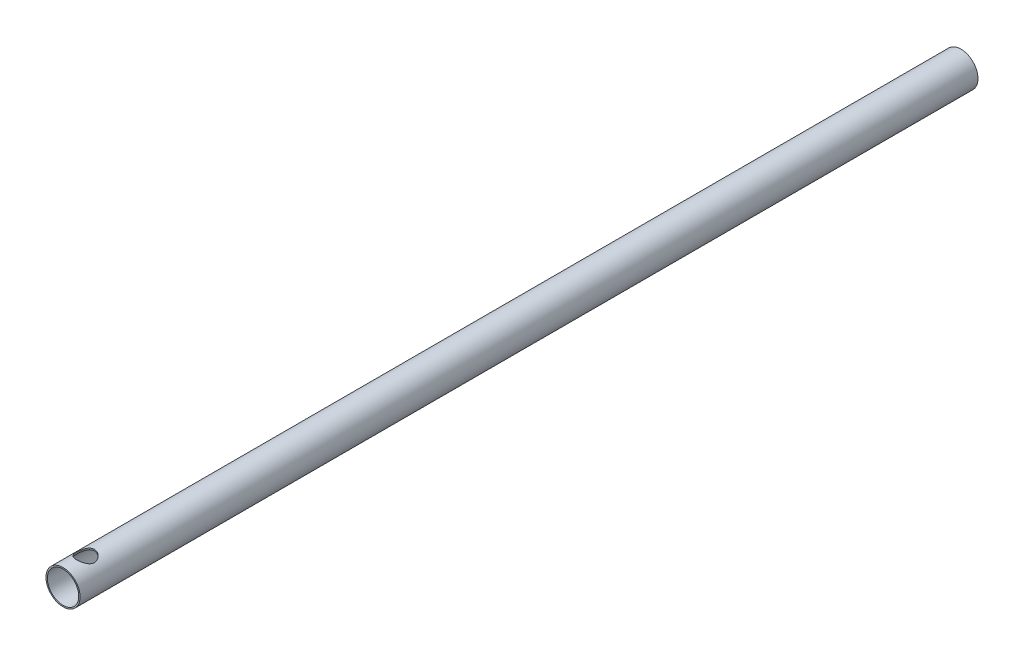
from build123d import *

# Parameters (mm, degrees)
SKETCH1_R          = 38
SKETCH1_R_2        = 35
EXTRUDE1_DEPTH     = 2000
SKETCH2_R          = 20
CUT_EXTRUDE1_DEPTH = 60
SKETCH3_R          = 20
CUT_EXTRUDE2_DEPTH = 60


with BuildPart() as part:
    # Sketch1 → Extrude1 (new body)
    with BuildSketch(Plane.XY):
        Circle(SKETCH1_R)
        Circle(SKETCH1_R_2, mode=Mode.SUBTRACT)
    extrude(amount=EXTRUDE1_DEPTH)

    # Sketch2 → Cut-Extrude1 (cut)
    with BuildSketch(Plane(origin=(0, 0, 0), x_dir=(-1, 0, 0), z_dir=(0, 1, 0))):
        with Locations(Location((0, 50, 0), (0, 0, 90))):
            Circle(SKETCH2_R)
    extrude(amount=-CUT_EXTRUDE1_DEPTH, mode=Mode.SUBTRACT)

    # Sketch3 → Cut-Extrude2 (cut)
    with BuildSketch(Plane(origin=(0, 0, 0), x_dir=(-1, 0, 0), z_dir=(0, 1, 0))):
        with Locations(Location((0, 1950, 0), (0, 0, 270))):
            Circle(SKETCH3_R)
    extrude(amount=CUT_EXTRUDE2_DEPTH, mode=Mode.SUBTRACT)


solid = part.part
